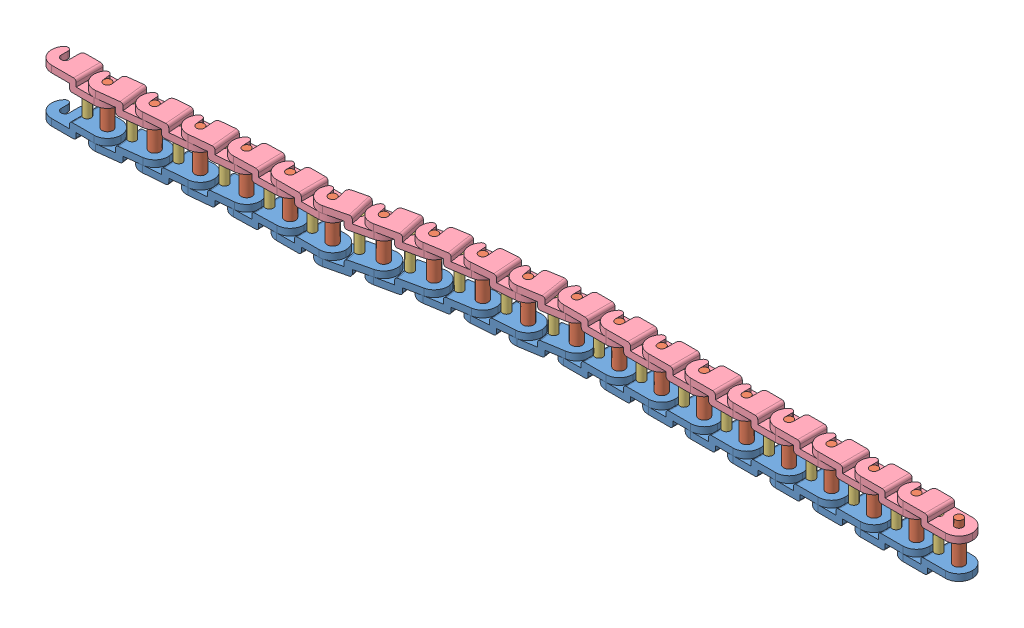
SolidWorks assembly Chain.SLDASM, configuration Default (file format 4400). Lengths in mm.
Overall size (129.42 7.85 11.73).
100 component instances, 4 part files, 38 mates.
Components (placement in the parent):
- AssemChain link-1: AssemChain link.SLDASM [Default] at origin size (10.3 7.85 4)
  - Link Rechts-1: Link Rechts.SLDPRT [Default] at origin size (10.3 2 4)
  - Chain As 1-1: Chain As 1.SLDPRT [Default] at (3.15 2 0) x (-0.521599 0 0.853191) z (-0.853191 0 -0.521599) size (1.6 7.85 1.6)
  - Chain As 2-1: Chain As 2.SLDPRT [Default] at (0.15 1 0) size (1.16 5.85 1.16)
  - Link Links-1: Link Links.SLDPRT [Default] at (0 7.85 0) x (1 0 0) z (0 0 -1) size (10.3 2 4)
- AssemChain link-2: AssemChain link.SLDASM [Default] at (6.2781 0 -0.3705) x (0.99306 0 -0.117607) z (0.117607 0 0.99306) size (10.3 7.85 4)
  - Link Rechts-1: Link Rechts.SLDPRT [Default] at origin size (10.3 2 4)
  - Chain As 1-1: Chain As 1.SLDPRT [Default] at (3.15 2 0) x (-0.521599 0 0.853191) z (-0.853191 0 -0.521599) size (1.6 7.85 1.6)
  - Chain As 2-1: Chain As 2.SLDPRT [Default] at (0.15 1 0) size (1.16 5.85 1.16)
  - Link Links-1: Link Links.SLDPRT [Default] at (0 7.85 0) x (1 0 0) z (0 0 -1) size (10.3 2 4)
- AssemChain link-3: AssemChain link.SLDASM [Default] at (12.5465 0 -0.9885) x (0.996907 0 -0.07859) z (0.07859 0 0.996907) size (10.3 7.85 4)
  - Link Rechts-1: Link Rechts.SLDPRT [Default] at origin size (10.3 2 4)
  - Chain As 1-1: Chain As 1.SLDPRT [Default] at (3.15 2 0) x (-0.521599 0 0.853191) z (-0.853191 0 -0.521599) size (1.6 7.85 1.6)
  - Chain As 2-1: Chain As 2.SLDPRT [Default] at (0.15 1 0) size (1.16 5.85 1.16)
  - Link Links-1: Link Links.SLDPRT [Default] at (0 7.85 0) x (1 0 0) z (0 0 -1) size (10.3 2 4)
- AssemChain link-4: AssemChain link.SLDASM [Default] at (18.8225 0 -1.5356) x (0.995469 0 -0.095087) z (0.095087 0 0.995469) size (10.3 7.85 4)
  - Link Rechts-1: Link Rechts.SLDPRT [Default] at origin size (10.3 2 4)
  - Chain As 1-1: Chain As 1.SLDPRT [Default] at (3.15 2 0) x (-0.521599 0 0.853191) z (-0.853191 0 -0.521599) size (1.6 7.85 1.6)
  - Chain As 2-1: Chain As 2.SLDPRT [Default] at (0.15 1 0) size (1.16 5.85 1.16)
  - Link Links-1: Link Links.SLDPRT [Default] at (0 7.85 0) x (1 0 0) z (0 0 -1) size (10.3 2 4)
- AssemChain link-5: AssemChain link.SLDASM [Default] at (43.765 0 -4.1193) x (0.978044 0 -0.208398) z (0.208398 0 0.978044) size (10.3 7.85 4)
  - Link Rechts-1: Link Rechts.SLDPRT [Default] at origin size (10.3 2 4)
  - Chain As 1-1: Chain As 1.SLDPRT [Default] at (3.15 2 0) x (-0.521599 0 0.853191) z (-0.853191 0 -0.521599) size (1.6 7.85 1.6)
  - Chain As 2-1: Chain As 2.SLDPRT [Default] at (0.15 1 0) size (1.16 5.85 1.16)
  - Link Links-1: Link Links.SLDPRT [Default] at (0 7.85 0) x (1 0 0) z (0 0 -1) size (10.3 2 4)
- AssemChain link-6: AssemChain link.SLDASM [Default] at (37.6202 0 -2.7316) x (0.972683 0 -0.232136) z (0.232136 0 0.972683) size (10.3 7.85 4)
  - Link Rechts-1: Link Rechts.SLDPRT [Default] at origin size (10.3 2 4)
  - Chain As 1-1: Chain As 1.SLDPRT [Default] at (3.15 2 0) x (-0.521599 0 0.853191) z (-0.853191 0 -0.521599) size (1.6 7.85 1.6)
  - Chain As 2-1: Chain As 2.SLDPRT [Default] at (0.15 1 0) size (1.16 5.85 1.16)
  - Link Links-1: Link Links.SLDPRT [Default] at (0 7.85 0) x (1 0 0) z (0 0 -1) size (10.3 2 4)
- AssemChain link-7: AssemChain link.SLDASM [Default] at (31.4063 0 -1.9966) x (0.999999 0 -0.001207) z (0.001207 0 0.999999) size (10.3 7.85 4)
  - Link Rechts-1: Link Rechts.SLDPRT [Default] at origin size (10.3 2 4)
  - Chain As 1-1: Chain As 1.SLDPRT [Default] at (3.15 2 0) x (-0.521599 0 0.853191) z (-0.853191 0 -0.521599) size (1.6 7.85 1.6)
  - Chain As 2-1: Chain As 2.SLDPRT [Default] at (0.15 1 0) size (1.16 5.85 1.16)
  - Link Links-1: Link Links.SLDPRT [Default] at (0 7.85 0) x (1 0 0) z (0 0 -1) size (10.3 2 4)
- AssemChain link-8: AssemChain link.SLDASM [Default] at (25.1073 0 -1.9139) x (0.999687 0 -0.025027) z (0.025027 0 0.999687) size (10.3 7.85 4)
  - Link Rechts-1: Link Rechts.SLDPRT [Default] at origin size (10.3 2 4)
  - Chain As 1-1: Chain As 1.SLDPRT [Default] at (3.15 2 0) x (-0.521599 0 0.853191) z (-0.853191 0 -0.521599) size (1.6 7.85 1.6)
  - Chain As 2-1: Chain As 2.SLDPRT [Default] at (0.15 1 0) size (1.16 5.85 1.16)
  - Link Links-1: Link Links.SLDPRT [Default] at (0 7.85 0) x (1 0 0) z (0 0 -1) size (10.3 2 4)
- AssemChain link-9: AssemChain link.SLDASM [Default] at (49.9569 0 -5.2696) x (0.987634 0 -0.156774) z (0.156774 0 0.987634) size (10.3 7.85 4)
  - Link Rechts-1: Link Rechts.SLDPRT [Default] at origin size (10.3 2 4)
  - Chain As 1-1: Chain As 1.SLDPRT [Default] at (3.15 2 0) x (-0.521599 0 0.853191) z (-0.853191 0 -0.521599) size (1.6 7.85 1.6)
  - Chain As 2-1: Chain As 2.SLDPRT [Default] at (0.15 1 0) size (1.16 5.85 1.16)
  - Link Links-1: Link Links.SLDPRT [Default] at (0 7.85 0) x (1 0 0) z (0 0 -1) size (10.3 2 4)
- AssemChain link-10: AssemChain link.SLDASM [Default] at (56.2096 0 -5.992) x (0.997363 0 -0.072578) z (0.072578 0 0.997363) size (10.3 7.85 4)
  - Link Rechts-1: Link Rechts.SLDPRT [Default] at origin size (10.3 2 4)
  - Chain As 1-1: Chain As 1.SLDPRT [Default] at (3.15 2 0) x (-0.521599 0 0.853191) z (-0.853191 0 -0.521599) size (1.6 7.85 1.6)
  - Chain As 2-1: Chain As 2.SLDPRT [Default] at (0.15 1 0) size (1.16 5.85 1.16)
  - Link Links-1: Link Links.SLDPRT [Default] at (0 7.85 0) x (1 0 0) z (0 0 -1) size (10.3 2 4)
- AssemChain link-11: AssemChain link.SLDASM [Default] at (62.4619 0 -6.7176) x (0.987476 0 -0.157768) z (0.157768 0 0.987476) size (10.3 7.85 4)
  - Link Rechts-1: Link Rechts.SLDPRT [Default] at origin size (10.3 2 4)
  - Chain As 1-1: Chain As 1.SLDPRT [Default] at (3.15 2 0) x (-0.521599 0 0.853191) z (-0.853191 0 -0.521599) size (1.6 7.85 1.6)
  - Chain As 2-1: Chain As 2.SLDPRT [Default] at (0.15 1 0) size (1.16 5.85 1.16)
  - Link Links-1: Link Links.SLDPRT [Default] at (0 7.85 0) x (1 0 0) z (0 0 -1) size (10.3 2 4)
- AssemChain link-12: AssemChain link.SLDASM [Default] at (68.7224 0 -7.2146) size (10.3 7.85 4)
  - Link Rechts-1: Link Rechts.SLDPRT [Default] at origin size (10.3 2 4)
  - Chain As 1-1: Chain As 1.SLDPRT [Default] at (3.15 2 0) x (-0.521599 0 0.853191) z (-0.853191 0 -0.521599) size (1.6 7.85 1.6)
  - Chain As 2-1: Chain As 2.SLDPRT [Default] at (0.15 1 0) size (1.16 5.85 1.16)
  - Link Links-1: Link Links.SLDPRT [Default] at (0 7.85 0) x (1 0 0) z (0 0 -1) size (10.3 2 4)
- AssemChain link-13: AssemChain link.SLDASM [Default] at (75.0224 0 -7.2146) size (10.3 7.85 4)
  - Link Rechts-1: Link Rechts.SLDPRT [Default] at origin size (10.3 2 4)
  - Chain As 1-1: Chain As 1.SLDPRT [Default] at (3.15 2 0) x (-0.521599 0 0.853191) z (-0.853191 0 -0.521599) size (1.6 7.85 1.6)
  - Chain As 2-1: Chain As 2.SLDPRT [Default] at (0.15 1 0) size (1.16 5.85 1.16)
  - Link Links-1: Link Links.SLDPRT [Default] at (0 7.85 0) x (1 0 0) z (0 0 -1) size (10.3 2 4)
- AssemChain link-14: AssemChain link.SLDASM [Default] at (81.3224 0 -7.2146) size (10.3 7.85 4)
  - Link Rechts-1: Link Rechts.SLDPRT [Default] at origin size (10.3 2 4)
  - Chain As 1-1: Chain As 1.SLDPRT [Default] at (3.15 2 0) x (-0.521599 0 0.853191) z (-0.853191 0 -0.521599) size (1.6 7.85 1.6)
  - Chain As 2-1: Chain As 2.SLDPRT [Default] at (0.15 1 0) size (1.16 5.85 1.16)
  - Link Links-1: Link Links.SLDPRT [Default] at (0 7.85 0) x (1 0 0) z (0 0 -1) size (10.3 2 4)
- AssemChain link-15: AssemChain link.SLDASM [Default] at (87.6224 0 -7.2146) size (10.3 7.85 4)
  - Link Rechts-1: Link Rechts.SLDPRT [Default] at origin size (10.3 2 4)
  - Chain As 1-1: Chain As 1.SLDPRT [Default] at (3.15 2 0) x (-0.521599 0 0.853191) z (-0.853191 0 -0.521599) size (1.6 7.85 1.6)
  - Chain As 2-1: Chain As 2.SLDPRT [Default] at (0.15 1 0) size (1.16 5.85 1.16)
  - Link Links-1: Link Links.SLDPRT [Default] at (0 7.85 0) x (1 0 0) z (0 0 -1) size (10.3 2 4)
- AssemChain link-16: AssemChain link.SLDASM [Default] at (100.2224 0 -7.2146) size (10.3 7.85 4)
  - Link Rechts-1: Link Rechts.SLDPRT [Default] at origin size (10.3 2 4)
  - Chain As 1-1: Chain As 1.SLDPRT [Default] at (3.15 2 0) x (-0.521599 0 0.853191) z (-0.853191 0 -0.521599) size (1.6 7.85 1.6)
  - Chain As 2-1: Chain As 2.SLDPRT [Default] at (0.15 1 0) size (1.16 5.85 1.16)
  - Link Links-1: Link Links.SLDPRT [Default] at (0 7.85 0) x (1 0 0) z (0 0 -1) size (10.3 2 4)
- AssemChain link-17: AssemChain link.SLDASM [Default] at (106.5224 0 -7.2146) size (10.3 7.85 4)
  - Link Rechts-1: Link Rechts.SLDPRT [Default] at origin size (10.3 2 4)
  - Chain As 1-1: Chain As 1.SLDPRT [Default] at (3.15 2 0) x (-0.521599 0 0.853191) z (-0.853191 0 -0.521599) size (1.6 7.85 1.6)
  - Chain As 2-1: Chain As 2.SLDPRT [Default] at (0.15 1 0) size (1.16 5.85 1.16)
  - Link Links-1: Link Links.SLDPRT [Default] at (0 7.85 0) x (1 0 0) z (0 0 -1) size (10.3 2 4)
- AssemChain link-18: AssemChain link.SLDASM [Default] at (112.8224 0 -7.2146) size (10.3 7.85 4)
  - Link Rechts-1: Link Rechts.SLDPRT [Default] at origin size (10.3 2 4)
  - Chain As 1-1: Chain As 1.SLDPRT [Default] at (3.15 2 0) x (-0.521599 0 0.853191) z (-0.853191 0 -0.521599) size (1.6 7.85 1.6)
  - Chain As 2-1: Chain As 2.SLDPRT [Default] at (0.15 1 0) size (1.16 5.85 1.16)
  - Link Links-1: Link Links.SLDPRT [Default] at (0 7.85 0) x (1 0 0) z (0 0 -1) size (10.3 2 4)
- AssemChain link-19: AssemChain link.SLDASM [Default] at (93.9224 0 -7.2146) size (10.3 7.85 4)
  - Link Rechts-1: Link Rechts.SLDPRT [Default] at origin size (10.3 2 4)
  - Chain As 1-1: Chain As 1.SLDPRT [Default] at (3.15 2 0) x (-0.521599 0 0.853191) z (-0.853191 0 -0.521599) size (1.6 7.85 1.6)
  - Chain As 2-1: Chain As 2.SLDPRT [Default] at (0.15 1 0) size (1.16 5.85 1.16)
  - Link Links-1: Link Links.SLDPRT [Default] at (0 7.85 0) x (1 0 0) z (0 0 -1) size (10.3 2 4)
- AssemChain link-20: AssemChain link.SLDASM [Default] at (119.1224 0 -7.2146) size (10.3 7.85 4)
  - Link Rechts-1: Link Rechts.SLDPRT [Default] at origin size (10.3 2 4)
  - Chain As 1-1: Chain As 1.SLDPRT [Default] at (3.15 2 0) x (-0.521599 0 0.853191) z (-0.853191 0 -0.521599) size (1.6 7.85 1.6)
  - Chain As 2-1: Chain As 2.SLDPRT [Default] at (0.15 1 0) size (1.16 5.85 1.16)
  - Link Links-1: Link Links.SLDPRT [Default] at (0 7.85 0) x (1 0 0) z (0 0 -1) size (10.3 2 4)
Mates (geometry in assembly coordinates):
- Concentric1: concentric aligned: cylinder of AssemChain link-1/Chain As 1-1 through (3.15 0 0) axis (0 1 0) radius 0.59; cylinder of AssemChain link-2/Link Rechts-1 through (3.15 0 0) axis (0 1 0) radius 0.59
- Coincident1: coincident anti-aligned: plane of AssemChain link-1/Link Rechts-1 through (3.15 1 0) normal (0 -1 0); plane of AssemChain link-2/Link Rechts-1 through (3.15 1 0) normal (0 1 0)
- Concentric2: concentric aligned: cylinder of AssemChain link-2/Chain As 1-1 through (9.4063 0 -0.7409) axis (0 1 0) radius 0.59; cylinder of AssemChain link-3/Link Rechts-1 through (9.4063 0 -0.7409) axis (0 1 0) radius 0.59
- Coincident3: coincident anti-aligned: plane of AssemChain link-2/Link Rechts-1 through (9.4063 1 -0.7409) normal (0 -1 0); plane of AssemChain link-3/Link Rechts-1 through (9.4063 1 -0.7409) normal (0 1 0)
- Coincident4: coincident anti-aligned: plane of AssemChain link-3/Link Rechts-1 through (15.6868 1 -1.236) normal (0 -1 0); plane of AssemChain link-4/Link Rechts-1 through (15.6868 1 -1.236) normal (0 1 0)
- Concentric3: concentric aligned: cylinder of AssemChain link-3/Chain As 1-1 through (15.6868 0 -1.236) axis (0 1 0) radius 0.59; cylinder of AssemChain link-4/Link Rechts-1 through (15.6868 0 -1.236) axis (0 1 0) radius 0.59
- Coincident5: coincident anti-aligned: plane of AssemChain link-4/Link Rechts-1 through (21.9582 1 -1.8351) normal (0 -1 0); plane of AssemChain link-5/Link Rechts-1 through (40.6842 1 -3.4628) normal (0 1 0)
- Coincident6: coincident anti-aligned: plane of AssemChain link-4/Link Rechts-1 through (21.9582 1 -1.8351) normal (0 -1 0); plane of AssemChain link-6/Link Rechts-1 through (34.5563 1 -2.0004) normal (0 1 0)
- Coincident7: coincident anti-aligned: plane of AssemChain link-4/Link Rechts-1 through (21.9582 1 -1.8351) normal (0 -1 0); plane of AssemChain link-7/Link Rechts-1 through (28.2563 1 -1.9928) normal (0 1 0)
- Coincident8: coincident anti-aligned: plane of AssemChain link-4/Link Rechts-1 through (21.9582 1 -1.8351) normal (0 -1 0); plane of AssemChain link-8/Link Rechts-1 through (21.9582 1 -1.8351) normal (0 1 0)
- Coincident9: coincident anti-aligned: plane of AssemChain link-4/Link Rechts-1 through (21.9582 1 -1.8351) normal (0 -1 0); plane of AssemChain link-9/Link Rechts-1 through (46.8459 1 -4.7757) normal (0 1 0)
- Coincident10: coincident anti-aligned: plane of AssemChain link-4/Link Rechts-1 through (21.9582 1 -1.8351) normal (0 -1 0); plane of AssemChain link-11/Link Rechts-1 through (59.3513 1 -6.2207) normal (0 1 0)
- Coincident11: coincident anti-aligned: plane of AssemChain link-4/Link Rechts-1 through (21.9582 1 -1.8351) normal (0 -1 0); plane of AssemChain link-10/Link Rechts-1 through (53.0679 1 -5.7634) normal (0 1 0)
- Concentric4: concentric aligned: cylinder of AssemChain link-4/Chain As 1-1 through (21.9582 0 -1.8351) axis (0 1 0) radius 0.59; cylinder of AssemChain link-8/Link Rechts-1 through (21.9582 0 -1.8351) axis (0 1 0) radius 0.59
- Concentric5: concentric aligned: cylinder of AssemChain link-7/Link Rechts-1 through (28.2563 0 -1.9928) axis (0 1 0) radius 0.59; cylinder of AssemChain link-8/Chain As 1-1 through (28.2563 0 -1.9928) axis (0 1 0) radius 0.59
- Concentric6: concentric aligned: cylinder of AssemChain link-6/Link Rechts-1 through (34.5563 0 -2.0004) axis (0 1 0) radius 0.59; cylinder of AssemChain link-7/Chain As 1-1 through (34.5563 0 -2.0004) axis (0 1 0) radius 0.59
- Concentric7: concentric aligned: cylinder of AssemChain link-5/Link Rechts-1 through (40.6842 0 -3.4628) axis (0 1 0) radius 0.59; cylinder of AssemChain link-6/Chain As 1-1 through (40.6842 0 -3.4628) axis (0 1 0) radius 0.59
- Concentric8: concentric aligned: cylinder of AssemChain link-5/Chain As 1-1 through (46.8459 0 -4.7757) axis (0 1 0) radius 0.59; cylinder of AssemChain link-9/Link Rechts-1 through (46.8459 0 -4.7757) axis (0 1 0) radius 0.59
- Concentric9: concentric aligned: cylinder of AssemChain link-9/Chain As 1-1 through (53.0679 0 -5.7634) axis (0 1 0) radius 0.59; cylinder of AssemChain link-10/Link Rechts-1 through (53.0679 0 -5.7634) axis (0 1 0) radius 0.59
- Concentric10: concentric aligned: cylinder of AssemChain link-10/Chain As 1-1 through (59.3513 0 -6.2207) axis (0 1 0) radius 0.59; cylinder of AssemChain link-11/Link Rechts-1 through (59.3513 0 -6.2207) axis (0 1 0) radius 0.59
- Coincident12: coincident anti-aligned: plane of AssemChain link-11/Link Rechts-1 through (65.5724 1 -7.2146) normal (0 -1 0); plane of AssemChain link-12/Link Rechts-1 through (65.5724 1 -7.2146) normal (0 1 0)
- Coincident13: coincident anti-aligned: plane of AssemChain link-11/Link Rechts-1 through (65.5724 1 -7.2146) normal (0 -1 0); plane of AssemChain link-13/Link Rechts-1 through (71.8724 1 -7.2146) normal (0 1 0)
- Coincident14: coincident anti-aligned: plane of AssemChain link-11/Link Rechts-1 through (65.5724 1 -7.2146) normal (0 -1 0); plane of AssemChain link-14/Link Rechts-1 through (78.1724 1 -7.2146) normal (0 1 0)
- Coincident15: coincident anti-aligned: plane of AssemChain link-11/Link Rechts-1 through (65.5724 1 -7.2146) normal (0 -1 0); plane of AssemChain link-15/Link Rechts-1 through (84.4724 1 -7.2146) normal (0 1 0)
- Coincident16: coincident anti-aligned: plane of AssemChain link-11/Link Rechts-1 through (65.5724 1 -7.2146) normal (0 -1 0); plane of AssemChain link-19/Link Rechts-1 through (90.7724 1 -7.2146) normal (0 1 0)
- Coincident17: coincident anti-aligned: plane of AssemChain link-11/Link Rechts-1 through (65.5724 1 -7.2146) normal (0 -1 0); plane of AssemChain link-18/Link Rechts-1 through (109.6724 1 -7.2146) normal (0 1 0)
- Coincident18: coincident anti-aligned: plane of AssemChain link-11/Link Rechts-1 through (65.5724 1 -7.2146) normal (0 -1 0); plane of AssemChain link-16/Link Rechts-1 through (97.0724 1 -7.2146) normal (0 1 0)
- Coincident19: coincident anti-aligned: plane of AssemChain link-11/Link Rechts-1 through (65.5724 1 -7.2146) normal (0 -1 0); plane of AssemChain link-17/Link Rechts-1 through (103.3724 1 -7.2146) normal (0 1 0)
- Coincident20: coincident anti-aligned: plane of AssemChain link-11/Link Rechts-1 through (65.5724 1 -7.2146) normal (0 -1 0); plane of AssemChain link-20/Link Rechts-1 through (128.1669 1 -17.6809) normal (0 1 0)
- Concentric11: concentric aligned: cylinder of AssemChain link-11/Chain As 1-1 through (65.5724 0 -7.2146) axis (0 1 0) radius 0.59; cylinder of AssemChain link-12/Link Rechts-1 through (65.5724 0 -7.2146) axis (0 1 0) radius 0.59
- Concentric12: concentric aligned: cylinder of AssemChain link-12/Chain As 1-1 through (71.8724 0 -7.2146) axis (0 1 0) radius 0.59; cylinder of AssemChain link-13/Link Rechts-1 through (71.8724 0 -7.2146) axis (0 1 0) radius 0.59
- Concentric13: concentric aligned: cylinder of AssemChain link-13/Chain As 1-1 through (78.1724 0 -7.2146) axis (0 1 0) radius 0.59; cylinder of AssemChain link-14/Link Rechts-1 through (78.1724 0 -7.2146) axis (0 1 0) radius 0.59
- Concentric14: concentric aligned: cylinder of AssemChain link-14/Chain As 1-1 through (84.4724 0 -7.2146) axis (0 1 0) radius 0.59; cylinder of AssemChain link-15/Link Rechts-1 through (84.4724 0 -7.2146) axis (0 1 0) radius 0.59
- Concentric15: concentric aligned: cylinder of AssemChain link-15/Chain As 1-1 through (90.7724 0 -7.2146) axis (0 1 0) radius 0.59; cylinder of AssemChain link-19/Link Rechts-1 through (90.7724 0 -7.2146) axis (0 1 0) radius 0.59
- Concentric16: concentric aligned: cylinder of AssemChain link-16/Link Rechts-1 through (97.0724 0 -7.2146) axis (0 1 0) radius 0.59; cylinder of AssemChain link-19/Chain As 1-1 through (97.0724 0 -7.2146) axis (0 1 0) radius 0.59
- Concentric17: concentric aligned: cylinder of AssemChain link-16/Chain As 1-1 through (103.3724 0 -7.2146) axis (0 1 0) radius 0.59; cylinder of AssemChain link-17/Link Rechts-1 through (103.3724 0 -7.2146) axis (0 1 0) radius 0.59
- Concentric18: concentric aligned: cylinder of AssemChain link-17/Chain As 1-1 through (109.6724 0 -7.2146) axis (0 1 0) radius 0.59; cylinder of AssemChain link-18/Link Rechts-1 through (109.6724 0 -7.2146) axis (0 1 0) radius 0.59
- Concentric19: concentric aligned: cylinder of AssemChain link-18/Chain As 1-1 through (115.9724 0 -7.2146) axis (0 1 0) radius 0.59; cylinder of AssemChain link-20/Link Rechts-1 through (115.9724 0 -7.2146) axis (0 1 0) radius 0.59
